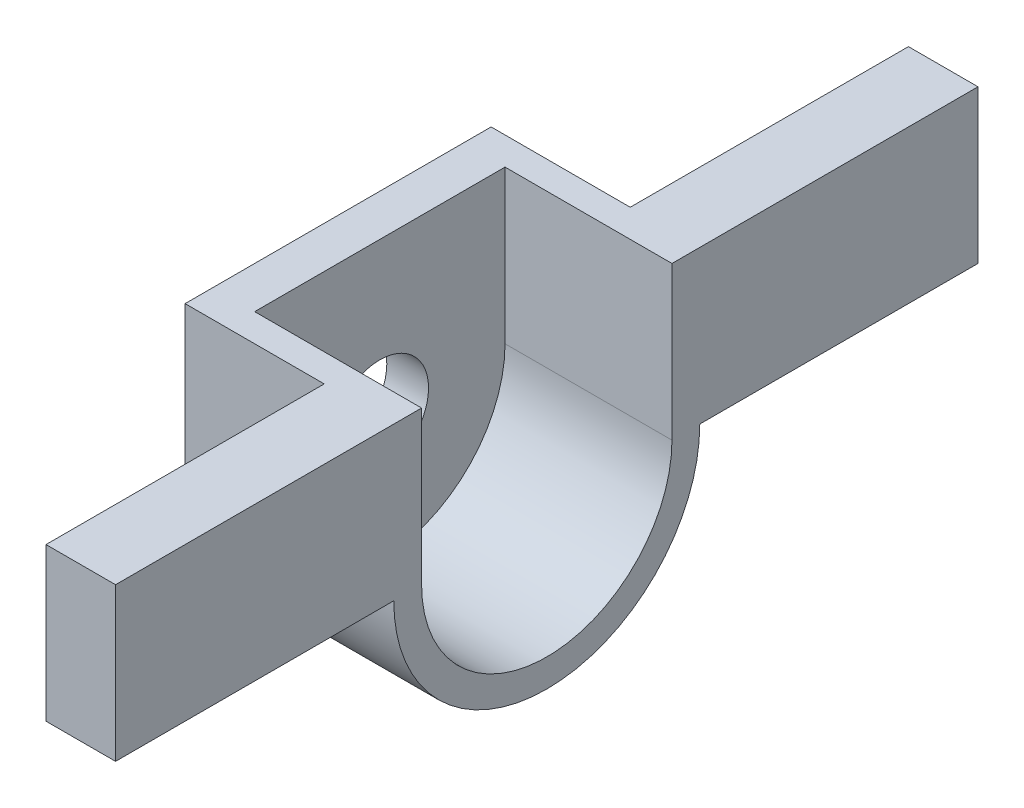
ISO-10303-21;
HEADER;
FILE_DESCRIPTION(('STEP AP214'),'2;1');
FILE_NAME('part.step','',(''),(''),'','','');
FILE_SCHEMA(('AUTOMOTIVE_DESIGN { 1 0 10303 214 1 1 1 1 }'));
ENDSEC;
DATA;
#1=APPLICATION_CONTEXT('core data for automotive mechanical design processes');
#2=APPLICATION_PROTOCOL_DEFINITION('international standard','automotive_design',2000,#1);
#3=PRODUCT_CONTEXT('',#1,'mechanical');
#4=PRODUCT('Part','Part','',(#3));
#5=PRODUCT_RELATED_PRODUCT_CATEGORY('part','',(#4));
#6=PRODUCT_DEFINITION_FORMATION('','',#4);
#7=PRODUCT_DEFINITION_CONTEXT('part definition',#1,'design');
#8=PRODUCT_DEFINITION('design','',#6,#7);
#9=PRODUCT_DEFINITION_SHAPE('','',#8);
#10=(LENGTH_UNIT() NAMED_UNIT(*) SI_UNIT(.MILLI.,.METRE.));
#11=(NAMED_UNIT(*) PLANE_ANGLE_UNIT() SI_UNIT($,.RADIAN.));
#12=(NAMED_UNIT(*) SI_UNIT($,.STERADIAN.) SOLID_ANGLE_UNIT());
#13=UNCERTAINTY_MEASURE_WITH_UNIT(LENGTH_MEASURE(1.E-05),#10,'distance_accuracy_value','');
#14=(GEOMETRIC_REPRESENTATION_CONTEXT(3) GLOBAL_UNCERTAINTY_ASSIGNED_CONTEXT((#13)) GLOBAL_UNIT_ASSIGNED_CONTEXT((#10,
#11,#12)) REPRESENTATION_CONTEXT('',''));
#15=CARTESIAN_POINT('',(0.,0.,0.));
#16=DIRECTION('',(0.,0.,1.));
#17=DIRECTION('',(1.,0.,0.));
#18=AXIS2_PLACEMENT_3D('',#15,#16,#17);
#19=CARTESIAN_POINT('',(15.,0.,11.));
#20=DIRECTION('',(0.,0.,-1.));
#21=DIRECTION('',(-1.,0.,0.));
#22=AXIS2_PLACEMENT_3D('',#19,#20,#21);
#23=PLANE('',#22);
#24=DIRECTION('',(0.,-1.,0.));
#25=VECTOR('',#24,1.);
#26=CARTESIAN_POINT('',(10.,11.,11.));
#27=LINE('',#26,#25);
#28=CARTESIAN_POINT('',(10.,11.,11.));
#29=VERTEX_POINT('',#28);
#30=CARTESIAN_POINT('',(10.,0.,11.));
#31=VERTEX_POINT('',#30);
#32=EDGE_CURVE('E59',#29,#31,#27,.T.);
#33=ORIENTED_EDGE('',*,*,#32,.F.);
#34=DIRECTION('',(-1.,0.,0.));
#35=VECTOR('',#34,1.);
#36=CARTESIAN_POINT('',(15.,11.,11.));
#37=LINE('',#36,#35);
#38=CARTESIAN_POINT('',(0.,11.,11.));
#39=VERTEX_POINT('',#38);
#40=EDGE_CURVE('E281',#29,#39,#37,.T.);
#41=ORIENTED_EDGE('',*,*,#40,.T.);
#42=DIRECTION('',(0.,-1.,0.));
#43=VECTOR('',#42,1.);
#44=CARTESIAN_POINT('',(0.,0.,11.));
#45=LINE('',#44,#43);
#46=CARTESIAN_POINT('',(0.,0.,11.));
#47=VERTEX_POINT('',#46);
#48=EDGE_CURVE('E258',#39,#47,#45,.T.);
#49=ORIENTED_EDGE('',*,*,#48,.T.);
#50=DIRECTION('',(-1.,0.,0.));
#51=VECTOR('',#50,1.);
#52=CARTESIAN_POINT('',(15.,0.,11.));
#53=LINE('',#52,#51);
#54=EDGE_CURVE('E263',#31,#47,#53,.T.);
#55=ORIENTED_EDGE('',*,*,#54,.F.);
#56=EDGE_LOOP('',(#33,#41,#49,#55));
#57=FACE_BOUND('',#56,.T.);
#58=ADVANCED_FACE('F43',(#57),#23,.F.);
#59=CARTESIAN_POINT('',(15.,11.,11.));
#60=DIRECTION('',(0.,-1.,0.));
#61=DIRECTION('',(0.,0.,-1.));
#62=AXIS2_PLACEMENT_3D('',#59,#60,#61);
#63=PLANE('',#62);
#64=DIRECTION('',(1.,0.,0.));
#65=VECTOR('',#64,1.);
#66=CARTESIAN_POINT('',(3.,11.,9.));
#67=LINE('',#66,#65);
#68=CARTESIAN_POINT('',(3.,11.,9.));
#69=VERTEX_POINT('',#68);
#70=CARTESIAN_POINT('',(15.,11.,9.));
#71=VERTEX_POINT('',#70);
#72=EDGE_CURVE('E249',#69,#71,#67,.T.);
#73=ORIENTED_EDGE('',*,*,#72,.F.);
#74=DIRECTION('',(0.,0.,-1.));
#75=VECTOR('',#74,1.);
#76=CARTESIAN_POINT('',(3.,11.,9.));
#77=LINE('',#76,#75);
#78=CARTESIAN_POINT('',(3.,11.,-9.));
#79=VERTEX_POINT('',#78);
#80=EDGE_CURVE('E218',#69,#79,#77,.T.);
#81=ORIENTED_EDGE('',*,*,#80,.T.);
#82=DIRECTION('',(1.,0.,0.));
#83=VECTOR('',#82,1.);
#84=CARTESIAN_POINT('',(3.,11.,-9.));
#85=LINE('',#84,#83);
#86=CARTESIAN_POINT('',(15.,11.,-9.));
#87=VERTEX_POINT('',#86);
#88=EDGE_CURVE('E245',#79,#87,#85,.T.);
#89=ORIENTED_EDGE('',*,*,#88,.T.);
#90=DIRECTION('',(0.,0.,1.));
#91=VECTOR('',#90,1.);
#92=CARTESIAN_POINT('',(15.,11.,11.));
#93=LINE('',#92,#91);
#94=CARTESIAN_POINT('',(15.,11.,-31.));
#95=VERTEX_POINT('',#94);
#96=EDGE_CURVE('E259',#95,#87,#93,.T.);
#97=ORIENTED_EDGE('',*,*,#96,.F.);
#98=DIRECTION('',(-1.,0.,0.));
#99=VECTOR('',#98,1.);
#100=CARTESIAN_POINT('',(15.,11.,-31.));
#101=LINE('',#100,#99);
#102=CARTESIAN_POINT('',(10.,11.,-31.));
#103=VERTEX_POINT('',#102);
#104=EDGE_CURVE('E187',#95,#103,#101,.T.);
#105=ORIENTED_EDGE('',*,*,#104,.T.);
#106=DIRECTION('',(0.,0.,1.));
#107=VECTOR('',#106,1.);
#108=CARTESIAN_POINT('',(10.,11.,-31.));
#109=LINE('',#108,#107);
#110=CARTESIAN_POINT('',(10.,11.,-11.));
#111=VERTEX_POINT('',#110);
#112=EDGE_CURVE('E200',#103,#111,#109,.T.);
#113=ORIENTED_EDGE('',*,*,#112,.T.);
#114=DIRECTION('',(-1.,0.,0.));
#115=VECTOR('',#114,1.);
#116=CARTESIAN_POINT('',(15.,11.,-11.));
#117=LINE('',#116,#115);
#118=CARTESIAN_POINT('',(0.,11.,-11.));
#119=VERTEX_POINT('',#118);
#120=EDGE_CURVE('E283',#111,#119,#117,.T.);
#121=ORIENTED_EDGE('',*,*,#120,.T.);
#122=DIRECTION('',(0.,0.,1.));
#123=VECTOR('',#122,1.);
#124=CARTESIAN_POINT('',(0.,11.,11.));
#125=LINE('',#124,#123);
#126=EDGE_CURVE('E271',#119,#39,#125,.T.);
#127=ORIENTED_EDGE('',*,*,#126,.T.);
#128=ORIENTED_EDGE('',*,*,#40,.F.);
#129=DIRECTION('',(0.,0.,-1.));
#130=VECTOR('',#129,1.);
#131=CARTESIAN_POINT('',(10.,11.,31.));
#132=LINE('',#131,#130);
#133=CARTESIAN_POINT('',(10.,11.,31.));
#134=VERTEX_POINT('',#133);
#135=EDGE_CURVE('E160',#134,#29,#132,.T.);
#136=ORIENTED_EDGE('',*,*,#135,.F.);
#137=DIRECTION('',(-1.,0.,0.));
#138=VECTOR('',#137,1.);
#139=CARTESIAN_POINT('',(15.,11.,31.));
#140=LINE('',#139,#138);
#141=CARTESIAN_POINT('',(15.,11.,31.));
#142=VERTEX_POINT('',#141);
#143=EDGE_CURVE('E148',#142,#134,#140,.T.);
#144=ORIENTED_EDGE('',*,*,#143,.F.);
#145=EDGE_CURVE('E257',#71,#142,#93,.T.);
#146=ORIENTED_EDGE('',*,*,#145,.F.);
#147=EDGE_LOOP('',(#73,#81,#89,#97,#105,#113,#121,#127,#128,#136,#144,#146));
#148=FACE_BOUND('',#147,.T.);
#149=ADVANCED_FACE('F302',(#148),#63,.F.);
#150=CARTESIAN_POINT('',(15.,0.,0.));
#151=DIRECTION('',(1.,0.,0.));
#152=DIRECTION('',(0.,0.,-1.));
#153=AXIS2_PLACEMENT_3D('',#150,#151,#152);
#154=PLANE('',#153);
#155=CARTESIAN_POINT('',(15.,0.,0.));
#156=DIRECTION('',(1.,0.,0.));
#157=DIRECTION('',(0.,0.,-1.));
#158=AXIS2_PLACEMENT_3D('',#155,#156,#157);
#159=CIRCLE('',#158,9.);
#160=CARTESIAN_POINT('',(15.,0.,9.));
#161=VERTEX_POINT('',#160);
#162=CARTESIAN_POINT('',(15.,0.,-9.));
#163=VERTEX_POINT('',#162);
#164=EDGE_CURVE('E219',#161,#163,#159,.T.);
#165=ORIENTED_EDGE('',*,*,#164,.F.);
#166=DIRECTION('',(0.,1.,0.));
#167=VECTOR('',#166,1.);
#168=CARTESIAN_POINT('',(15.,0.,9.));
#169=LINE('',#168,#167);
#170=EDGE_CURVE('E67',#161,#71,#169,.T.);
#171=ORIENTED_EDGE('',*,*,#170,.T.);
#172=ORIENTED_EDGE('',*,*,#145,.T.);
#173=DIRECTION('',(0.,-1.,0.));
#174=VECTOR('',#173,1.);
#175=CARTESIAN_POINT('',(15.,11.,31.));
#176=LINE('',#175,#174);
#177=CARTESIAN_POINT('',(15.,0.,31.));
#178=VERTEX_POINT('',#177);
#179=EDGE_CURVE('E161',#142,#178,#176,.T.);
#180=ORIENTED_EDGE('',*,*,#179,.T.);
#181=DIRECTION('',(0.,0.,-1.));
#182=VECTOR('',#181,1.);
#183=CARTESIAN_POINT('',(15.,0.,31.));
#184=LINE('',#183,#182);
#185=CARTESIAN_POINT('',(15.,0.,11.));
#186=VERTEX_POINT('',#185);
#187=EDGE_CURVE('E165',#178,#186,#184,.T.);
#188=ORIENTED_EDGE('',*,*,#187,.T.);
#189=CARTESIAN_POINT('',(15.,0.,0.));
#190=DIRECTION('',(1.,0.,0.));
#191=DIRECTION('',(0.,0.,-1.));
#192=AXIS2_PLACEMENT_3D('',#189,#190,#191);
#193=CIRCLE('',#192,11.);
#194=CARTESIAN_POINT('',(15.,0.,-11.));
#195=VERTEX_POINT('',#194);
#196=EDGE_CURVE('E253',#186,#195,#193,.T.);
#197=ORIENTED_EDGE('',*,*,#196,.T.);
#198=DIRECTION('',(0.,0.,1.));
#199=VECTOR('',#198,1.);
#200=CARTESIAN_POINT('',(15.,0.,-31.));
#201=LINE('',#200,#199);
#202=CARTESIAN_POINT('',(15.,0.,-31.));
#203=VERTEX_POINT('',#202);
#204=EDGE_CURVE('E194',#203,#195,#201,.T.);
#205=ORIENTED_EDGE('',*,*,#204,.F.);
#206=DIRECTION('',(0.,-1.,0.));
#207=VECTOR('',#206,1.);
#208=CARTESIAN_POINT('',(15.,11.,-31.));
#209=LINE('',#208,#207);
#210=EDGE_CURVE('E191',#95,#203,#209,.T.);
#211=ORIENTED_EDGE('',*,*,#210,.F.);
#212=ORIENTED_EDGE('',*,*,#96,.T.);
#213=DIRECTION('',(0.,1.,0.));
#214=VECTOR('',#213,1.);
#215=CARTESIAN_POINT('',(15.,0.,-9.));
#216=LINE('',#215,#214);
#217=EDGE_CURVE('E234',#163,#87,#216,.T.);
#218=ORIENTED_EDGE('',*,*,#217,.F.);
#219=EDGE_LOOP('',(#165,#171,#172,#180,#188,#197,#205,#211,#212,#218));
#220=FACE_BOUND('',#219,.T.);
#221=ADVANCED_FACE('F305',(#220),#154,.T.);
#222=CARTESIAN_POINT('',(15.,0.,0.));
#223=DIRECTION('',(-1.,0.,0.));
#224=DIRECTION('',(0.,0.,1.));
#225=AXIS2_PLACEMENT_3D('',#222,#223,#224);
#226=CYLINDRICAL_SURFACE('',#225,11.);
#227=CARTESIAN_POINT('',(0.,0.,0.));
#228=DIRECTION('',(1.,0.,0.));
#229=DIRECTION('',(0.,0.,-1.));
#230=AXIS2_PLACEMENT_3D('',#227,#228,#229);
#231=CIRCLE('',#230,11.);
#232=CARTESIAN_POINT('',(0.,0.,-11.));
#233=VERTEX_POINT('',#232);
#234=EDGE_CURVE('E252',#47,#233,#231,.T.);
#235=ORIENTED_EDGE('',*,*,#234,.T.);
#236=DIRECTION('',(-1.,0.,0.));
#237=VECTOR('',#236,1.);
#238=CARTESIAN_POINT('',(15.,0.,-11.));
#239=LINE('',#238,#237);
#240=CARTESIAN_POINT('',(10.,0.,-11.));
#241=VERTEX_POINT('',#240);
#242=EDGE_CURVE('E52',#241,#233,#239,.T.);
#243=ORIENTED_EDGE('',*,*,#242,.F.);
#244=EDGE_CURVE('E11',#195,#241,#239,.T.);
#245=ORIENTED_EDGE('',*,*,#244,.F.);
#246=ORIENTED_EDGE('',*,*,#196,.F.);
#247=EDGE_CURVE('E278',#186,#31,#53,.T.);
#248=ORIENTED_EDGE('',*,*,#247,.T.);
#249=ORIENTED_EDGE('',*,*,#54,.T.);
#250=EDGE_LOOP('',(#235,#243,#245,#246,#248,#249));
#251=FACE_BOUND('',#250,.T.);
#252=ADVANCED_FACE('F45',(#251),#226,.T.);
#253=CARTESIAN_POINT('',(15.,0.,-11.));
#254=DIRECTION('',(0.,0.,1.));
#255=DIRECTION('',(1.,0.,0.));
#256=AXIS2_PLACEMENT_3D('',#253,#254,#255);
#257=PLANE('',#256);
#258=ORIENTED_EDGE('',*,*,#120,.F.);
#259=DIRECTION('',(0.,-1.,0.));
#260=VECTOR('',#259,1.);
#261=CARTESIAN_POINT('',(10.,11.,-11.));
#262=LINE('',#261,#260);
#263=EDGE_CURVE('E177',#111,#241,#262,.T.);
#264=ORIENTED_EDGE('',*,*,#263,.T.);
#265=ORIENTED_EDGE('',*,*,#242,.T.);
#266=DIRECTION('',(0.,1.,0.));
#267=VECTOR('',#266,1.);
#268=CARTESIAN_POINT('',(0.,0.,-11.));
#269=LINE('',#268,#267);
#270=EDGE_CURVE('E267',#233,#119,#269,.T.);
#271=ORIENTED_EDGE('',*,*,#270,.T.);
#272=EDGE_LOOP('',(#258,#264,#265,#271));
#273=FACE_BOUND('',#272,.T.);
#274=ADVANCED_FACE('F291',(#273),#257,.F.);
#275=CARTESIAN_POINT('',(0.,0.,0.));
#276=DIRECTION('',(1.,0.,0.));
#277=DIRECTION('',(0.,0.,-1.));
#278=AXIS2_PLACEMENT_3D('',#275,#276,#277);
#279=PLANE('',#278);
#280=CARTESIAN_POINT('',(0.,0.,0.));
#281=DIRECTION('',(1.,0.,0.));
#282=DIRECTION('',(0.,0.,-1.));
#283=AXIS2_PLACEMENT_3D('',#280,#281,#282);
#284=CIRCLE('',#283,3.5);
#285=CARTESIAN_POINT('',(0.,0.,-3.5));
#286=VERTEX_POINT('',#285);
#287=EDGE_CURVE('E207',#286,#286,#284,.T.);
#288=ORIENTED_EDGE('',*,*,#287,.T.);
#289=EDGE_LOOP('',(#288));
#290=FACE_BOUND('',#289,.T.);
#291=ORIENTED_EDGE('',*,*,#234,.F.);
#292=ORIENTED_EDGE('',*,*,#48,.F.);
#293=ORIENTED_EDGE('',*,*,#126,.F.);
#294=ORIENTED_EDGE('',*,*,#270,.F.);
#295=EDGE_LOOP('',(#291,#292,#293,#294));
#296=FACE_BOUND('',#295,.T.);
#297=ADVANCED_FACE('F298',(#290,#296),#279,.F.);
#298=CARTESIAN_POINT('',(3.,0.,9.));
#299=DIRECTION('',(0.,0.,-1.));
#300=DIRECTION('',(-1.,0.,0.));
#301=AXIS2_PLACEMENT_3D('',#298,#299,#300);
#302=PLANE('',#301);
#303=ORIENTED_EDGE('',*,*,#170,.F.);
#304=DIRECTION('',(1.,0.,0.));
#305=VECTOR('',#304,1.);
#306=CARTESIAN_POINT('',(3.,0.,9.));
#307=LINE('',#306,#305);
#308=CARTESIAN_POINT('',(3.,0.,9.));
#309=VERTEX_POINT('',#308);
#310=EDGE_CURVE('E231',#309,#161,#307,.T.);
#311=ORIENTED_EDGE('',*,*,#310,.F.);
#312=DIRECTION('',(0.,1.,0.));
#313=VECTOR('',#312,1.);
#314=CARTESIAN_POINT('',(3.,0.,9.));
#315=LINE('',#314,#313);
#316=EDGE_CURVE('E214',#309,#69,#315,.T.);
#317=ORIENTED_EDGE('',*,*,#316,.T.);
#318=ORIENTED_EDGE('',*,*,#72,.T.);
#319=EDGE_LOOP('',(#303,#311,#317,#318));
#320=FACE_BOUND('',#319,.T.);
#321=ADVANCED_FACE('F322',(#320),#302,.T.);
#322=CARTESIAN_POINT('',(3.,0.,-9.));
#323=DIRECTION('',(0.,0.,-1.));
#324=DIRECTION('',(-1.,0.,0.));
#325=AXIS2_PLACEMENT_3D('',#322,#323,#324);
#326=PLANE('',#325);
#327=ORIENTED_EDGE('',*,*,#217,.T.);
#328=ORIENTED_EDGE('',*,*,#88,.F.);
#329=DIRECTION('',(0.,1.,0.));
#330=VECTOR('',#329,1.);
#331=CARTESIAN_POINT('',(3.,0.,-9.));
#332=LINE('',#331,#330);
#333=CARTESIAN_POINT('',(3.,0.,-9.));
#334=VERTEX_POINT('',#333);
#335=EDGE_CURVE('E223',#334,#79,#332,.T.);
#336=ORIENTED_EDGE('',*,*,#335,.F.);
#337=DIRECTION('',(1.,0.,0.));
#338=VECTOR('',#337,1.);
#339=CARTESIAN_POINT('',(3.,0.,-9.));
#340=LINE('',#339,#338);
#341=EDGE_CURVE('E242',#334,#163,#340,.T.);
#342=ORIENTED_EDGE('',*,*,#341,.T.);
#343=EDGE_LOOP('',(#327,#328,#336,#342));
#344=FACE_BOUND('',#343,.T.);
#345=ADVANCED_FACE('F425',(#344),#326,.F.);
#346=CARTESIAN_POINT('',(3.,0.,0.));
#347=DIRECTION('',(1.,0.,0.));
#348=DIRECTION('',(0.,0.,-1.));
#349=AXIS2_PLACEMENT_3D('',#346,#347,#348);
#350=CYLINDRICAL_SURFACE('',#349,9.);
#351=ORIENTED_EDGE('',*,*,#164,.T.);
#352=ORIENTED_EDGE('',*,*,#341,.F.);
#353=CARTESIAN_POINT('',(3.,0.,0.));
#354=DIRECTION('',(1.,0.,0.));
#355=DIRECTION('',(0.,0.,-1.));
#356=AXIS2_PLACEMENT_3D('',#353,#354,#355);
#357=CIRCLE('',#356,9.);
#358=EDGE_CURVE('E227',#309,#334,#357,.T.);
#359=ORIENTED_EDGE('',*,*,#358,.F.);
#360=ORIENTED_EDGE('',*,*,#310,.T.);
#361=EDGE_LOOP('',(#351,#352,#359,#360));
#362=FACE_BOUND('',#361,.T.);
#363=ADVANCED_FACE('F415',(#362),#350,.F.);
#364=CARTESIAN_POINT('',(3.,0.,0.));
#365=DIRECTION('',(1.,0.,0.));
#366=DIRECTION('',(0.,0.,-1.));
#367=AXIS2_PLACEMENT_3D('',#364,#365,#366);
#368=PLANE('',#367);
#369=CARTESIAN_POINT('',(3.,0.,0.));
#370=DIRECTION('',(1.,0.,0.));
#371=DIRECTION('',(0.,0.,-1.));
#372=AXIS2_PLACEMENT_3D('',#369,#370,#371);
#373=CIRCLE('',#372,3.5);
#374=CARTESIAN_POINT('',(3.,0.,-3.5));
#375=VERTEX_POINT('',#374);
#376=EDGE_CURVE('E206',#375,#375,#373,.T.);
#377=ORIENTED_EDGE('',*,*,#376,.F.);
#378=EDGE_LOOP('',(#377));
#379=FACE_BOUND('',#378,.T.);
#380=ORIENTED_EDGE('',*,*,#316,.F.);
#381=ORIENTED_EDGE('',*,*,#358,.T.);
#382=ORIENTED_EDGE('',*,*,#335,.T.);
#383=ORIENTED_EDGE('',*,*,#80,.F.);
#384=EDGE_LOOP('',(#380,#381,#382,#383));
#385=FACE_BOUND('',#384,.T.);
#386=ADVANCED_FACE('F405',(#379,#385),#368,.T.);
#387=CARTESIAN_POINT('',(0.,0.,0.));
#388=DIRECTION('',(1.,0.,0.));
#389=DIRECTION('',(0.,0.,-1.));
#390=AXIS2_PLACEMENT_3D('',#387,#388,#389);
#391=CYLINDRICAL_SURFACE('',#390,3.5);
#392=ORIENTED_EDGE('',*,*,#287,.F.);
#393=EDGE_LOOP('',(#392));
#394=FACE_BOUND('',#393,.T.);
#395=ORIENTED_EDGE('',*,*,#376,.T.);
#396=EDGE_LOOP('',(#395));
#397=FACE_BOUND('',#396,.T.);
#398=ADVANCED_FACE('F395',(#394,#397),#391,.F.);
#399=CARTESIAN_POINT('',(15.,0.,-31.));
#400=DIRECTION('',(0.,1.,0.));
#401=DIRECTION('',(0.,0.,1.));
#402=AXIS2_PLACEMENT_3D('',#399,#400,#401);
#403=PLANE('',#402);
#404=ORIENTED_EDGE('',*,*,#244,.T.);
#405=DIRECTION('',(0.,0.,1.));
#406=VECTOR('',#405,1.);
#407=CARTESIAN_POINT('',(10.,0.,-31.));
#408=LINE('',#407,#406);
#409=CARTESIAN_POINT('',(10.,0.,-31.));
#410=VERTEX_POINT('',#409);
#411=EDGE_CURVE('E203',#410,#241,#408,.T.);
#412=ORIENTED_EDGE('',*,*,#411,.F.);
#413=DIRECTION('',(-1.,0.,0.));
#414=VECTOR('',#413,1.);
#415=CARTESIAN_POINT('',(15.,0.,-31.));
#416=LINE('',#415,#414);
#417=EDGE_CURVE('E180',#203,#410,#416,.T.);
#418=ORIENTED_EDGE('',*,*,#417,.F.);
#419=ORIENTED_EDGE('',*,*,#204,.T.);
#420=EDGE_LOOP('',(#404,#412,#418,#419));
#421=FACE_BOUND('',#420,.T.);
#422=ADVANCED_FACE('F385',(#421),#403,.F.);
#423=CARTESIAN_POINT('',(10.,11.,-31.));
#424=DIRECTION('',(-1.,0.,0.));
#425=DIRECTION('',(0.,-1.,0.));
#426=AXIS2_PLACEMENT_3D('',#423,#424,#425);
#427=PLANE('',#426);
#428=ORIENTED_EDGE('',*,*,#263,.F.);
#429=ORIENTED_EDGE('',*,*,#112,.F.);
#430=DIRECTION('',(0.,-1.,0.));
#431=VECTOR('',#430,1.);
#432=CARTESIAN_POINT('',(10.,11.,-31.));
#433=LINE('',#432,#431);
#434=EDGE_CURVE('E183',#103,#410,#433,.T.);
#435=ORIENTED_EDGE('',*,*,#434,.T.);
#436=ORIENTED_EDGE('',*,*,#411,.T.);
#437=EDGE_LOOP('',(#428,#429,#435,#436));
#438=FACE_BOUND('',#437,.T.);
#439=ADVANCED_FACE('F376',(#438),#427,.T.);
#440=CARTESIAN_POINT('',(0.,0.,-31.));
#441=DIRECTION('',(0.,0.,1.));
#442=DIRECTION('',(1.,0.,0.));
#443=AXIS2_PLACEMENT_3D('',#440,#441,#442);
#444=PLANE('',#443);
#445=ORIENTED_EDGE('',*,*,#417,.T.);
#446=ORIENTED_EDGE('',*,*,#434,.F.);
#447=ORIENTED_EDGE('',*,*,#104,.F.);
#448=ORIENTED_EDGE('',*,*,#210,.T.);
#449=EDGE_LOOP('',(#445,#446,#447,#448));
#450=FACE_BOUND('',#449,.T.);
#451=ADVANCED_FACE('F337',(#450),#444,.F.);
#452=CARTESIAN_POINT('',(15.,0.,31.));
#453=DIRECTION('',(0.,-1.,0.));
#454=DIRECTION('',(0.,0.,-1.));
#455=AXIS2_PLACEMENT_3D('',#452,#453,#454);
#456=PLANE('',#455);
#457=ORIENTED_EDGE('',*,*,#247,.F.);
#458=ORIENTED_EDGE('',*,*,#187,.F.);
#459=DIRECTION('',(-1.,0.,0.));
#460=VECTOR('',#459,1.);
#461=CARTESIAN_POINT('',(15.,0.,31.));
#462=LINE('',#461,#460);
#463=CARTESIAN_POINT('',(10.,0.,31.));
#464=VERTEX_POINT('',#463);
#465=EDGE_CURVE('E145',#178,#464,#462,.T.);
#466=ORIENTED_EDGE('',*,*,#465,.T.);
#467=DIRECTION('',(0.,0.,-1.));
#468=VECTOR('',#467,1.);
#469=CARTESIAN_POINT('',(10.,0.,31.));
#470=LINE('',#469,#468);
#471=EDGE_CURVE('E155',#464,#31,#470,.T.);
#472=ORIENTED_EDGE('',*,*,#471,.T.);
#473=EDGE_LOOP('',(#457,#458,#466,#472));
#474=FACE_BOUND('',#473,.T.);
#475=ADVANCED_FACE('F163',(#474),#456,.T.);
#476=CARTESIAN_POINT('',(10.,11.,31.));
#477=DIRECTION('',(1.,0.,0.));
#478=DIRECTION('',(0.,1.,0.));
#479=AXIS2_PLACEMENT_3D('',#476,#477,#478);
#480=PLANE('',#479);
#481=ORIENTED_EDGE('',*,*,#32,.T.);
#482=ORIENTED_EDGE('',*,*,#471,.F.);
#483=DIRECTION('',(0.,-1.,0.));
#484=VECTOR('',#483,1.);
#485=CARTESIAN_POINT('',(10.,11.,31.));
#486=LINE('',#485,#484);
#487=EDGE_CURVE('E140',#134,#464,#486,.T.);
#488=ORIENTED_EDGE('',*,*,#487,.F.);
#489=ORIENTED_EDGE('',*,*,#135,.T.);
#490=EDGE_LOOP('',(#481,#482,#488,#489));
#491=FACE_BOUND('',#490,.T.);
#492=ADVANCED_FACE('F156',(#491),#480,.F.);
#493=CARTESIAN_POINT('',(0.,0.,31.));
#494=DIRECTION('',(0.,0.,1.));
#495=DIRECTION('',(1.,0.,0.));
#496=AXIS2_PLACEMENT_3D('',#493,#494,#495);
#497=PLANE('',#496);
#498=ORIENTED_EDGE('',*,*,#465,.F.);
#499=ORIENTED_EDGE('',*,*,#179,.F.);
#500=ORIENTED_EDGE('',*,*,#143,.T.);
#501=ORIENTED_EDGE('',*,*,#487,.T.);
#502=EDGE_LOOP('',(#498,#499,#500,#501));
#503=FACE_BOUND('',#502,.T.);
#504=ADVANCED_FACE('F142',(#503),#497,.T.);
#505=CLOSED_SHELL('',(#58,#149,#221,#252,#274,#297,#321,#345,#363,#386,#398,#422,#439,#451,#475,
#492,#504));
#506=MANIFOLD_SOLID_BREP('B2',#505);
#507=ADVANCED_BREP_SHAPE_REPRESENTATION('',(#18,#506),#14);
#508=SHAPE_DEFINITION_REPRESENTATION(#9,#507);
ENDSEC;
END-ISO-10303-21;
